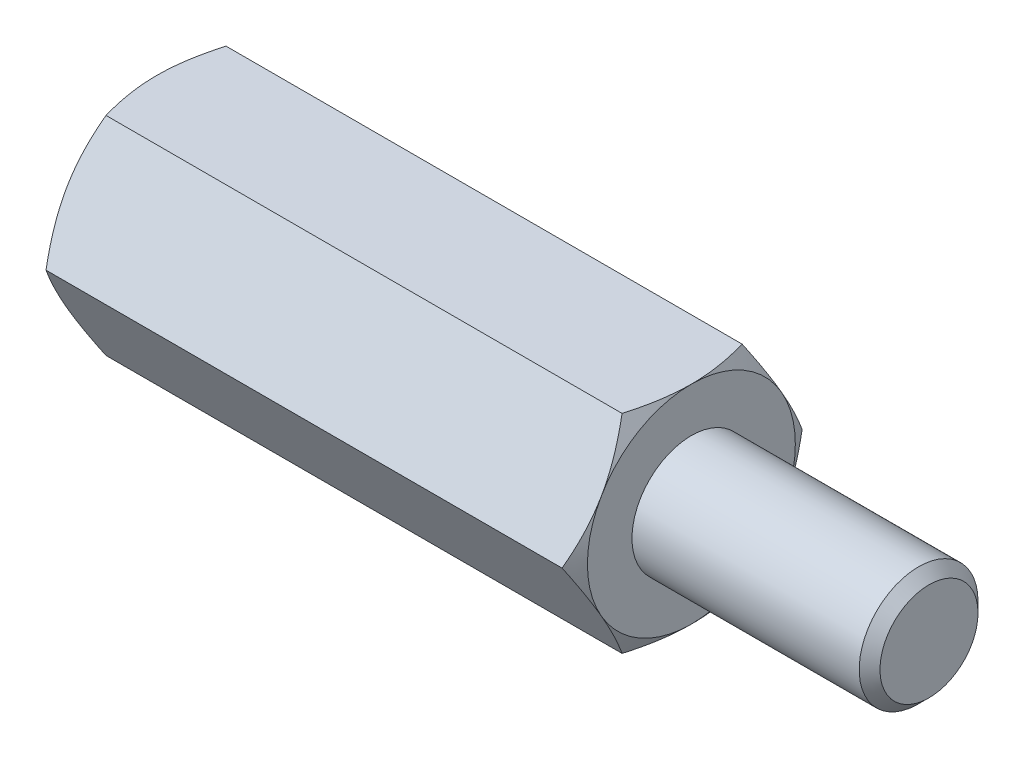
from build123d import *

# Parameters (mm, degrees)
EXTRUDE2_DEPTH = 9
SKETCH3_R      = 1.65
EXTRUDE3_DEPTH = 8
SKETCH5_R      = 2
EXTRUDE4_DEPTH = 8
CHAMFER1_SIZE  = 0.35


with BuildPart() as part:
    # Sketch1 → Extrude2 (new, symmetric)
    with BuildSketch(Plane(origin=(0, 0, 0), x_dir=(0, 0, -1), z_dir=(1, 0, 0))):
        Polygon((2.020725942, 3.5), (-2.020725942, 3.5), (-4.041451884, 0), (-2.020725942, -3.5), (2.020725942, -3.5), (4.041451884, 0), align=None)
    extrude(amount=EXTRUDE2_DEPTH, both=True)

    # Sketch2 → Cut-Revolve1 (revolve, cut)
    with BuildSketch(Plane.XY):
        with BuildLine():
            Line((-9, 3.5), (-7.5, 6.098076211))
            ThreePointArc((-7.5, 6.098076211), (-7.98810136, 7.276457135), (-9, 6.5))
            Line((-9, 6.5), (-9, 3.5))
        make_face()
    cut_revolve1 = revolve(axis=Axis((0, 0, 0), (1, 0, 0)), mode=Mode.SUBTRACT)

    # Mirror1: Cut-Revolve1 across plane
    add(cut_revolve1.mirror(Plane(origin=(0, 0, 0), x_dir=(0, 0, 1), z_dir=(1, 0, 0))), mode=Mode.SUBTRACT)

    # Sketch3 → Extrude3 (cut)
    with BuildSketch(Plane.ZY.offset(9)):
        Circle(SKETCH3_R)
    extrude(amount=-EXTRUDE3_DEPTH, mode=Mode.SUBTRACT)

    # Sketch4 → Cut-Revolve2 (revolve, cut)
    with BuildSketch(Plane.XY, mode=Mode.PRIVATE) as cut_revolve2_sk:
        Polygon((-1, 0), (-1, 1.65), (-0.047372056, 0), align=None)
    revolve(cut_revolve2_sk.sketch.rotate(Axis((-0.047372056, 0, 0), (-1, 0, 0)), 270), axis=Axis((-0.047372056, 0, 0), (-1, 0, 0)), mode=Mode.SUBTRACT)

    # Sketch5 → Extrude4 (add)
    with BuildSketch(Plane(origin=(9, 0, 0), x_dir=(0, 0, -1), z_dir=(1, 0, 0))):
        Circle(SKETCH5_R)
    extrude(amount=EXTRUDE4_DEPTH)

    # Chamfer1
    chamfer1_edges = [part.edges().sort_by_distance(p)[0] for p in [
        (17, 0, 2),
    ]]
    chamfer(chamfer1_edges, length=CHAMFER1_SIZE)


solid = part.part
